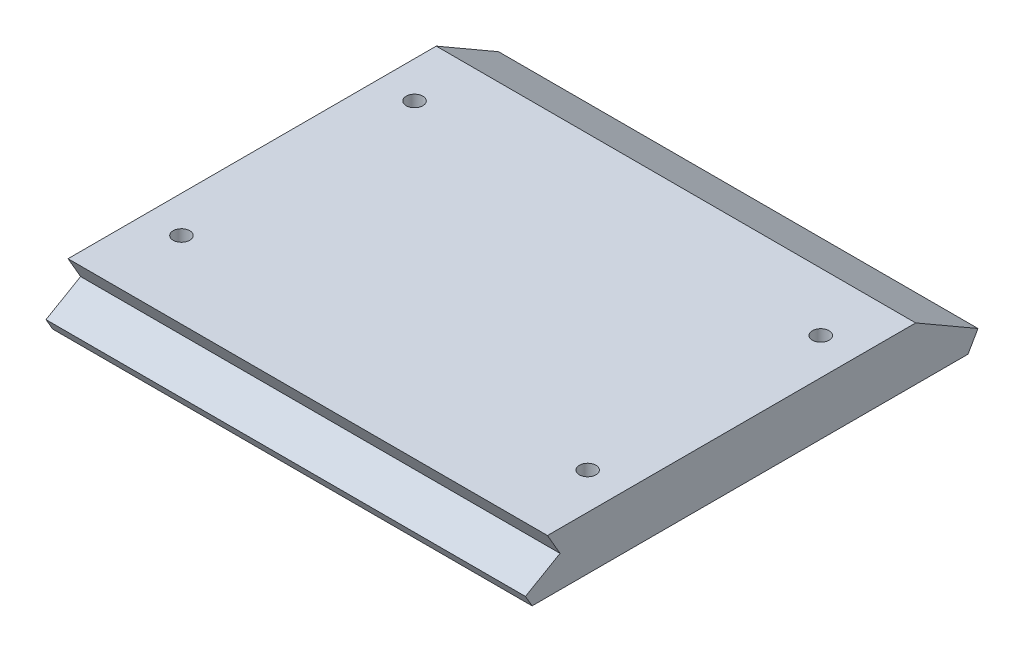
from build123d import *

# Parameters (mm, degrees)
BOSS_EXTRUDE1_DEPTH       = 36
M3X0_5_TAPPED_HOLE1_D     = 2.5
M3X0_5_TAPPED_HOLE1_DEPTH = 6.5
M3X0_5_TAPPED_HOLE1_TIP   = 0.751075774


with BuildPart() as part:
    # Sketch1 → Boss-Extrude1 (new, symmetric)
    with BuildSketch(Plane(origin=(0, 0, 0), x_dir=(0, 0, -1), z_dir=(1, 0, 0))):
        Polygon((0, 0), (65.46, 0), (66.96, 2.598076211), (57.603593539, 8), (2.309401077, 8), (4.196152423, 4.732050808), (-1, 1.732050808), align=None)
    extrude(amount=BOSS_EXTRUDE1_DEPTH, both=True)

    # M3x0.5 Tapped Hole1
    with Locations(Plane(origin=(0, 8, 0), x_dir=(1, 0, 0), z_dir=(0, 1, 0))):
        with Locations((30.5, 13.841197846), (30.5, 48.841197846), (-30.5, 13.841197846), (-30.5, 48.841197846)):
            Hole(M3X0_5_TAPPED_HOLE1_D / 2, depth=M3X0_5_TAPPED_HOLE1_DEPTH)
            with Locations((0, 0, -(M3X0_5_TAPPED_HOLE1_DEPTH + M3X0_5_TAPPED_HOLE1_TIP / 2))):  # 118° drill point
                Cone(0, M3X0_5_TAPPED_HOLE1_D / 2, M3X0_5_TAPPED_HOLE1_TIP, mode=Mode.SUBTRACT)


solid = part.part
